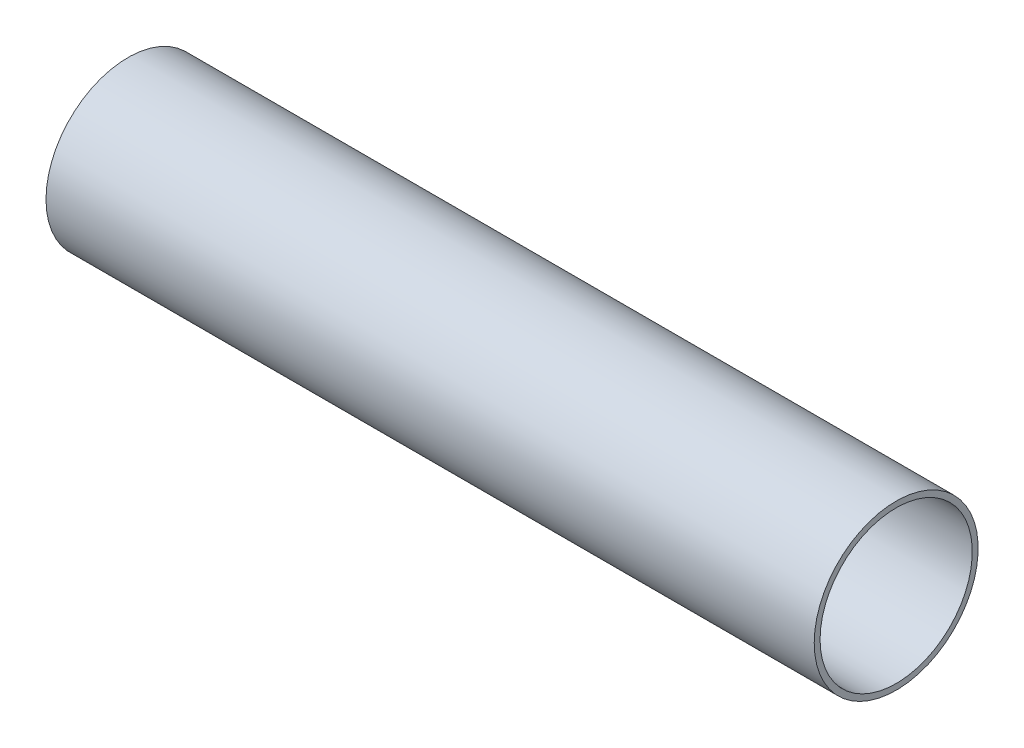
from build123d import *

# Parameters (mm, degrees)
ESQUISSE1_W = 131.2
ESQUISSE1_H = 1


with BuildPart() as part:
    # Esquisse1 → Base-R_volution (revolve)
    with BuildSketch(Plane.XY, mode=Mode.PRIVATE) as base_r_volution_sk:
        with Locations((65.6, 13.5)):
            Rectangle(ESQUISSE1_W, ESQUISSE1_H)
    revolve(base_r_volution_sk.sketch.rotate(Axis((0, 0, 0), (1, 0, 0)), 90), axis=Axis((0, 0, 0), (1, 0, 0)))


solid = part.part
